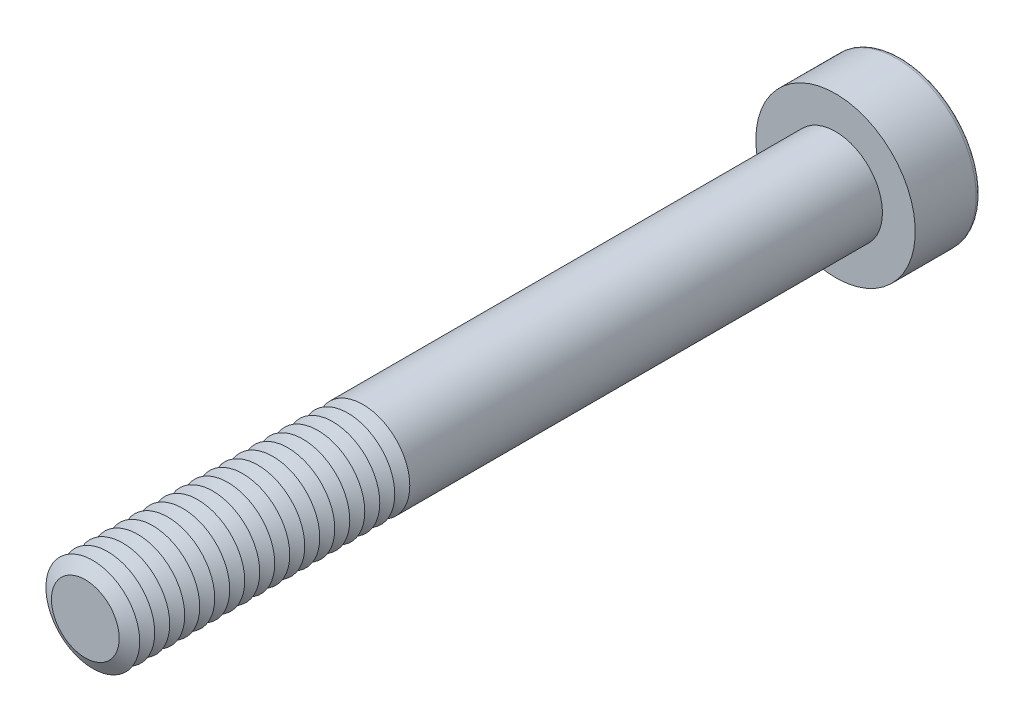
ISO-10303-21;
HEADER;
FILE_DESCRIPTION(('STEP AP214'),'2;1');
FILE_NAME('part.step','',(''),(''),'','','');
FILE_SCHEMA(('AUTOMOTIVE_DESIGN { 1 0 10303 214 1 1 1 1 }'));
ENDSEC;
DATA;
#1=APPLICATION_CONTEXT('core data for automotive mechanical design processes');
#2=APPLICATION_PROTOCOL_DEFINITION('international standard','automotive_design',2000,#1);
#3=PRODUCT_CONTEXT('',#1,'mechanical');
#4=PRODUCT('Part','Part','',(#3));
#5=PRODUCT_RELATED_PRODUCT_CATEGORY('part','',(#4));
#6=PRODUCT_DEFINITION_FORMATION('','',#4);
#7=PRODUCT_DEFINITION_CONTEXT('part definition',#1,'design');
#8=PRODUCT_DEFINITION('design','',#6,#7);
#9=PRODUCT_DEFINITION_SHAPE('','',#8);
#10=(LENGTH_UNIT() NAMED_UNIT(*) SI_UNIT(.MILLI.,.METRE.));
#11=(NAMED_UNIT(*) PLANE_ANGLE_UNIT() SI_UNIT($,.RADIAN.));
#12=(NAMED_UNIT(*) SI_UNIT($,.STERADIAN.) SOLID_ANGLE_UNIT());
#13=UNCERTAINTY_MEASURE_WITH_UNIT(LENGTH_MEASURE(1.E-05),#10,'distance_accuracy_value','');
#14=(GEOMETRIC_REPRESENTATION_CONTEXT(3) GLOBAL_UNCERTAINTY_ASSIGNED_CONTEXT((#13)) GLOBAL_UNIT_ASSIGNED_CONTEXT((#10,
#11,#12)) REPRESENTATION_CONTEXT('',''));
#15=CARTESIAN_POINT('',(0.,0.,0.));
#16=DIRECTION('',(0.,0.,1.));
#17=DIRECTION('',(1.,0.,0.));
#18=AXIS2_PLACEMENT_3D('',#15,#16,#17);
#19=CARTESIAN_POINT('',(0.,0.,37.2));
#20=DIRECTION('',(0.,0.,1.));
#21=DIRECTION('',(1.,0.,0.));
#22=AXIS2_PLACEMENT_3D('',#19,#20,#21);
#23=CONICAL_SURFACE('',#22,2.5,1.0471975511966);
#24=CARTESIAN_POINT('',(0.,0.,36.8));
#25=DIRECTION('',(0.,0.,1.));
#26=DIRECTION('',(1.,0.,0.));
#27=AXIS2_PLACEMENT_3D('',#24,#25,#26);
#28=CIRCLE('',#27,1.80717967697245);
#29=CARTESIAN_POINT('',(1.80717967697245,0.,36.8));
#30=VERTEX_POINT('',#29);
#31=EDGE_CURVE('E314',#30,#30,#28,.T.);
#32=ORIENTED_EDGE('',*,*,#31,.T.);
#33=EDGE_LOOP('',(#32));
#34=FACE_BOUND('',#33,.T.);
#35=CARTESIAN_POINT('',(0.,0.,37.2));
#36=DIRECTION('',(0.,0.,1.));
#37=DIRECTION('',(1.,0.,0.));
#38=AXIS2_PLACEMENT_3D('',#35,#36,#37);
#39=CIRCLE('',#38,2.5);
#40=CARTESIAN_POINT('',(2.5,0.,37.2));
#41=VERTEX_POINT('',#40);
#42=EDGE_CURVE('E317',#41,#41,#39,.T.);
#43=ORIENTED_EDGE('',*,*,#42,.F.);
#44=EDGE_LOOP('',(#43));
#45=FACE_BOUND('',#44,.T.);
#46=ADVANCED_FACE('F39',(#34,#45),#23,.T.);
#47=CARTESIAN_POINT('',(0.,0.,36.8));
#48=DIRECTION('',(0.,0.,-1.));
#49=DIRECTION('',(-1.,0.,0.));
#50=AXIS2_PLACEMENT_3D('',#47,#48,#49);
#51=CONICAL_SURFACE('',#50,1.80717967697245,1.04719755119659);
#52=CARTESIAN_POINT('',(0.,0.,36.4));
#53=DIRECTION('',(0.,0.,1.));
#54=DIRECTION('',(1.,0.,0.));
#55=AXIS2_PLACEMENT_3D('',#52,#53,#54);
#56=CIRCLE('',#55,2.5);
#57=CARTESIAN_POINT('',(2.5,0.,36.4));
#58=VERTEX_POINT('',#57);
#59=EDGE_CURVE('E325',#58,#58,#56,.T.);
#60=ORIENTED_EDGE('',*,*,#59,.T.);
#61=EDGE_LOOP('',(#60));
#62=FACE_BOUND('',#61,.T.);
#63=ORIENTED_EDGE('',*,*,#31,.F.);
#64=EDGE_LOOP('',(#63));
#65=FACE_BOUND('',#64,.T.);
#66=ADVANCED_FACE('F245',(#62,#65),#51,.T.);
#67=CARTESIAN_POINT('',(0.,0.,40.));
#68=DIRECTION('',(0.,0.,1.));
#69=DIRECTION('',(1.,0.,0.));
#70=AXIS2_PLACEMENT_3D('',#67,#68,#69);
#71=PLANE('',#70);
#72=CARTESIAN_POINT('',(0.,0.,40.));
#73=DIRECTION('',(0.,0.,1.));
#74=DIRECTION('',(1.,0.,0.));
#75=AXIS2_PLACEMENT_3D('',#72,#73,#74);
#76=CIRCLE('',#75,1.80717967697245);
#77=CARTESIAN_POINT('',(1.80717967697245,0.,40.));
#78=VERTEX_POINT('',#77);
#79=EDGE_CURVE('E174',#78,#78,#76,.T.);
#80=ORIENTED_EDGE('',*,*,#79,.T.);
#81=EDGE_LOOP('',(#80));
#82=FACE_BOUND('',#81,.T.);
#83=ADVANCED_FACE('F251',(#82),#71,.T.);
#84=CARTESIAN_POINT('',(0.,0.,40.));
#85=DIRECTION('',(0.,0.,-1.));
#86=DIRECTION('',(-1.,0.,0.));
#87=AXIS2_PLACEMENT_3D('',#84,#85,#86);
#88=CONICAL_SURFACE('',#87,1.80717967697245,1.04719755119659);
#89=CARTESIAN_POINT('',(0.,0.,39.6));
#90=DIRECTION('',(0.,0.,1.));
#91=DIRECTION('',(1.,0.,0.));
#92=AXIS2_PLACEMENT_3D('',#89,#90,#91);
#93=CIRCLE('',#92,2.5);
#94=CARTESIAN_POINT('',(2.5,0.,39.6));
#95=VERTEX_POINT('',#94);
#96=EDGE_CURVE('E291',#95,#95,#93,.T.);
#97=ORIENTED_EDGE('',*,*,#96,.T.);
#98=EDGE_LOOP('',(#97));
#99=FACE_BOUND('',#98,.T.);
#100=ORIENTED_EDGE('',*,*,#79,.F.);
#101=EDGE_LOOP('',(#100));
#102=FACE_BOUND('',#101,.T.);
#103=ADVANCED_FACE('F199',(#99,#102),#88,.T.);
#104=CARTESIAN_POINT('',(0.,0.,39.6));
#105=DIRECTION('',(0.,0.,1.));
#106=DIRECTION('',(1.,0.,0.));
#107=AXIS2_PLACEMENT_3D('',#104,#105,#106);
#108=CONICAL_SURFACE('',#107,2.5,1.0471975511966);
#109=CARTESIAN_POINT('',(0.,0.,39.2));
#110=DIRECTION('',(0.,0.,1.));
#111=DIRECTION('',(1.,0.,0.));
#112=AXIS2_PLACEMENT_3D('',#109,#110,#111);
#113=CIRCLE('',#112,1.80717967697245);
#114=CARTESIAN_POINT('',(1.80717967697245,0.,39.2));
#115=VERTEX_POINT('',#114);
#116=EDGE_CURVE('E288',#115,#115,#113,.T.);
#117=ORIENTED_EDGE('',*,*,#116,.T.);
#118=EDGE_LOOP('',(#117));
#119=FACE_BOUND('',#118,.T.);
#120=ORIENTED_EDGE('',*,*,#96,.F.);
#121=EDGE_LOOP('',(#120));
#122=FACE_BOUND('',#121,.T.);
#123=ADVANCED_FACE('F277',(#119,#122),#108,.T.);
#124=CARTESIAN_POINT('',(0.,0.,39.2));
#125=DIRECTION('',(0.,0.,-1.));
#126=DIRECTION('',(-1.,0.,0.));
#127=AXIS2_PLACEMENT_3D('',#124,#125,#126);
#128=CONICAL_SURFACE('',#127,1.80717967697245,1.04719755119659);
#129=CARTESIAN_POINT('',(0.,0.,38.8));
#130=DIRECTION('',(0.,0.,1.));
#131=DIRECTION('',(1.,0.,0.));
#132=AXIS2_PLACEMENT_3D('',#129,#130,#131);
#133=CIRCLE('',#132,2.5);
#134=CARTESIAN_POINT('',(2.5,0.,38.8));
#135=VERTEX_POINT('',#134);
#136=EDGE_CURVE('E300',#135,#135,#133,.T.);
#137=ORIENTED_EDGE('',*,*,#136,.T.);
#138=EDGE_LOOP('',(#137));
#139=FACE_BOUND('',#138,.T.);
#140=ORIENTED_EDGE('',*,*,#116,.F.);
#141=EDGE_LOOP('',(#140));
#142=FACE_BOUND('',#141,.T.);
#143=ADVANCED_FACE('F274',(#139,#142),#128,.T.);
#144=CARTESIAN_POINT('',(0.,0.,38.8));
#145=DIRECTION('',(0.,0.,1.));
#146=DIRECTION('',(1.,0.,0.));
#147=AXIS2_PLACEMENT_3D('',#144,#145,#146);
#148=CONICAL_SURFACE('',#147,2.5,1.0471975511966);
#149=CARTESIAN_POINT('',(0.,0.,38.4));
#150=DIRECTION('',(0.,0.,1.));
#151=DIRECTION('',(1.,0.,0.));
#152=AXIS2_PLACEMENT_3D('',#149,#150,#151);
#153=CIRCLE('',#152,1.80717967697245);
#154=CARTESIAN_POINT('',(1.80717967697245,0.,38.4));
#155=VERTEX_POINT('',#154);
#156=EDGE_CURVE('E293',#155,#155,#153,.T.);
#157=ORIENTED_EDGE('',*,*,#156,.T.);
#158=EDGE_LOOP('',(#157));
#159=FACE_BOUND('',#158,.T.);
#160=ORIENTED_EDGE('',*,*,#136,.F.);
#161=EDGE_LOOP('',(#160));
#162=FACE_BOUND('',#161,.T.);
#163=ADVANCED_FACE('F270',(#159,#162),#148,.T.);
#164=CARTESIAN_POINT('',(0.,0.,38.4));
#165=DIRECTION('',(0.,0.,-1.));
#166=DIRECTION('',(-1.,0.,0.));
#167=AXIS2_PLACEMENT_3D('',#164,#165,#166);
#168=CONICAL_SURFACE('',#167,1.80717967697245,1.04719755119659);
#169=CARTESIAN_POINT('',(0.,0.,38.));
#170=DIRECTION('',(0.,0.,1.));
#171=DIRECTION('',(1.,0.,0.));
#172=AXIS2_PLACEMENT_3D('',#169,#170,#171);
#173=CIRCLE('',#172,2.5);
#174=CARTESIAN_POINT('',(2.5,0.,38.));
#175=VERTEX_POINT('',#174);
#176=EDGE_CURVE('E310',#175,#175,#173,.T.);
#177=ORIENTED_EDGE('',*,*,#176,.T.);
#178=EDGE_LOOP('',(#177));
#179=FACE_BOUND('',#178,.T.);
#180=ORIENTED_EDGE('',*,*,#156,.F.);
#181=EDGE_LOOP('',(#180));
#182=FACE_BOUND('',#181,.T.);
#183=ADVANCED_FACE('F266',(#179,#182),#168,.T.);
#184=CARTESIAN_POINT('',(0.,0.,38.));
#185=DIRECTION('',(0.,0.,1.));
#186=DIRECTION('',(1.,0.,0.));
#187=AXIS2_PLACEMENT_3D('',#184,#185,#186);
#188=CONICAL_SURFACE('',#187,2.5,1.0471975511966);
#189=CARTESIAN_POINT('',(0.,0.,37.6));
#190=DIRECTION('',(0.,0.,1.));
#191=DIRECTION('',(1.,0.,0.));
#192=AXIS2_PLACEMENT_3D('',#189,#190,#191);
#193=CIRCLE('',#192,1.80717967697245);
#194=CARTESIAN_POINT('',(1.80717967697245,0.,37.6));
#195=VERTEX_POINT('',#194);
#196=EDGE_CURVE('E306',#195,#195,#193,.T.);
#197=ORIENTED_EDGE('',*,*,#196,.T.);
#198=EDGE_LOOP('',(#197));
#199=FACE_BOUND('',#198,.T.);
#200=ORIENTED_EDGE('',*,*,#176,.F.);
#201=EDGE_LOOP('',(#200));
#202=FACE_BOUND('',#201,.T.);
#203=ADVANCED_FACE('F262',(#199,#202),#188,.T.);
#204=CARTESIAN_POINT('',(0.,0.,37.6));
#205=DIRECTION('',(0.,0.,-1.));
#206=DIRECTION('',(-1.,0.,0.));
#207=AXIS2_PLACEMENT_3D('',#204,#205,#206);
#208=CONICAL_SURFACE('',#207,1.80717967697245,1.04719755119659);
#209=ORIENTED_EDGE('',*,*,#42,.T.);
#210=EDGE_LOOP('',(#209));
#211=FACE_BOUND('',#210,.T.);
#212=ORIENTED_EDGE('',*,*,#196,.F.);
#213=EDGE_LOOP('',(#212));
#214=FACE_BOUND('',#213,.T.);
#215=ADVANCED_FACE('F258',(#211,#214),#208,.T.);
#216=CARTESIAN_POINT('',(0.,0.,36.4));
#217=DIRECTION('',(0.,0.,1.));
#218=DIRECTION('',(1.,0.,0.));
#219=AXIS2_PLACEMENT_3D('',#216,#217,#218);
#220=CONICAL_SURFACE('',#219,2.5,1.0471975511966);
#221=CARTESIAN_POINT('',(0.,0.,36.));
#222=DIRECTION('',(0.,0.,1.));
#223=DIRECTION('',(1.,0.,0.));
#224=AXIS2_PLACEMENT_3D('',#221,#222,#223);
#225=CIRCLE('',#224,1.80717967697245);
#226=CARTESIAN_POINT('',(1.80717967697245,0.,36.));
#227=VERTEX_POINT('',#226);
#228=EDGE_CURVE('E321',#227,#227,#225,.T.);
#229=ORIENTED_EDGE('',*,*,#228,.T.);
#230=EDGE_LOOP('',(#229));
#231=FACE_BOUND('',#230,.T.);
#232=ORIENTED_EDGE('',*,*,#59,.F.);
#233=EDGE_LOOP('',(#232));
#234=FACE_BOUND('',#233,.T.);
#235=ADVANCED_FACE('F261',(#231,#234),#220,.T.);
#236=CARTESIAN_POINT('',(0.,0.,36.));
#237=DIRECTION('',(0.,0.,-1.));
#238=DIRECTION('',(-1.,0.,0.));
#239=AXIS2_PLACEMENT_3D('',#236,#237,#238);
#240=CONICAL_SURFACE('',#239,1.80717967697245,1.04719755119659);
#241=CARTESIAN_POINT('',(0.,0.,35.6));
#242=DIRECTION('',(0.,0.,1.));
#243=DIRECTION('',(1.,0.,0.));
#244=AXIS2_PLACEMENT_3D('',#241,#242,#243);
#245=CIRCLE('',#244,2.5);
#246=CARTESIAN_POINT('',(2.5,0.,35.6));
#247=VERTEX_POINT('',#246);
#248=EDGE_CURVE('E333',#247,#247,#245,.T.);
#249=ORIENTED_EDGE('',*,*,#248,.T.);
#250=EDGE_LOOP('',(#249));
#251=FACE_BOUND('',#250,.T.);
#252=ORIENTED_EDGE('',*,*,#228,.F.);
#253=EDGE_LOOP('',(#252));
#254=FACE_BOUND('',#253,.T.);
#255=ADVANCED_FACE('F545',(#251,#254),#240,.T.);
#256=CARTESIAN_POINT('',(0.,0.,35.6));
#257=DIRECTION('',(0.,0.,1.));
#258=DIRECTION('',(1.,0.,0.));
#259=AXIS2_PLACEMENT_3D('',#256,#257,#258);
#260=CONICAL_SURFACE('',#259,2.5,1.0471975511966);
#261=CARTESIAN_POINT('',(0.,0.,35.2));
#262=DIRECTION('',(0.,0.,1.));
#263=DIRECTION('',(1.,0.,0.));
#264=AXIS2_PLACEMENT_3D('',#261,#262,#263);
#265=CIRCLE('',#264,1.80717967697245);
#266=CARTESIAN_POINT('',(1.80717967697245,0.,35.2));
#267=VERTEX_POINT('',#266);
#268=EDGE_CURVE('E329',#267,#267,#265,.T.);
#269=ORIENTED_EDGE('',*,*,#268,.T.);
#270=EDGE_LOOP('',(#269));
#271=FACE_BOUND('',#270,.T.);
#272=ORIENTED_EDGE('',*,*,#248,.F.);
#273=EDGE_LOOP('',(#272));
#274=FACE_BOUND('',#273,.T.);
#275=ADVANCED_FACE('F541',(#271,#274),#260,.T.);
#276=CARTESIAN_POINT('',(0.,0.,35.2));
#277=DIRECTION('',(0.,0.,-1.));
#278=DIRECTION('',(-1.,0.,0.));
#279=AXIS2_PLACEMENT_3D('',#276,#277,#278);
#280=CONICAL_SURFACE('',#279,1.80717967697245,1.04719755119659);
#281=CARTESIAN_POINT('',(0.,0.,34.8));
#282=DIRECTION('',(0.,0.,1.));
#283=DIRECTION('',(1.,0.,0.));
#284=AXIS2_PLACEMENT_3D('',#281,#282,#283);
#285=CIRCLE('',#284,2.5);
#286=CARTESIAN_POINT('',(2.5,0.,34.8));
#287=VERTEX_POINT('',#286);
#288=EDGE_CURVE('E341',#287,#287,#285,.T.);
#289=ORIENTED_EDGE('',*,*,#288,.T.);
#290=EDGE_LOOP('',(#289));
#291=FACE_BOUND('',#290,.T.);
#292=ORIENTED_EDGE('',*,*,#268,.F.);
#293=EDGE_LOOP('',(#292));
#294=FACE_BOUND('',#293,.T.);
#295=ADVANCED_FACE('F537',(#291,#294),#280,.T.);
#296=CARTESIAN_POINT('',(0.,0.,34.8));
#297=DIRECTION('',(0.,0.,1.));
#298=DIRECTION('',(1.,0.,0.));
#299=AXIS2_PLACEMENT_3D('',#296,#297,#298);
#300=CONICAL_SURFACE('',#299,2.5,1.0471975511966);
#301=CARTESIAN_POINT('',(0.,0.,34.4));
#302=DIRECTION('',(0.,0.,1.));
#303=DIRECTION('',(1.,0.,0.));
#304=AXIS2_PLACEMENT_3D('',#301,#302,#303);
#305=CIRCLE('',#304,1.80717967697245);
#306=CARTESIAN_POINT('',(1.80717967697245,0.,34.4));
#307=VERTEX_POINT('',#306);
#308=EDGE_CURVE('E337',#307,#307,#305,.T.);
#309=ORIENTED_EDGE('',*,*,#308,.T.);
#310=EDGE_LOOP('',(#309));
#311=FACE_BOUND('',#310,.T.);
#312=ORIENTED_EDGE('',*,*,#288,.F.);
#313=EDGE_LOOP('',(#312));
#314=FACE_BOUND('',#313,.T.);
#315=ADVANCED_FACE('F533',(#311,#314),#300,.T.);
#316=CARTESIAN_POINT('',(0.,0.,34.4));
#317=DIRECTION('',(0.,0.,-1.));
#318=DIRECTION('',(-1.,0.,0.));
#319=AXIS2_PLACEMENT_3D('',#316,#317,#318);
#320=CONICAL_SURFACE('',#319,1.80717967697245,1.04719755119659);
#321=CARTESIAN_POINT('',(0.,0.,34.));
#322=DIRECTION('',(0.,0.,1.));
#323=DIRECTION('',(1.,0.,0.));
#324=AXIS2_PLACEMENT_3D('',#321,#322,#323);
#325=CIRCLE('',#324,2.5);
#326=CARTESIAN_POINT('',(2.5,0.,34.));
#327=VERTEX_POINT('',#326);
#328=EDGE_CURVE('E349',#327,#327,#325,.T.);
#329=ORIENTED_EDGE('',*,*,#328,.T.);
#330=EDGE_LOOP('',(#329));
#331=FACE_BOUND('',#330,.T.);
#332=ORIENTED_EDGE('',*,*,#308,.F.);
#333=EDGE_LOOP('',(#332));
#334=FACE_BOUND('',#333,.T.);
#335=ADVANCED_FACE('F529',(#331,#334),#320,.T.);
#336=CARTESIAN_POINT('',(0.,0.,34.));
#337=DIRECTION('',(0.,0.,1.));
#338=DIRECTION('',(1.,0.,0.));
#339=AXIS2_PLACEMENT_3D('',#336,#337,#338);
#340=CONICAL_SURFACE('',#339,2.5,1.0471975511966);
#341=CARTESIAN_POINT('',(0.,0.,33.6));
#342=DIRECTION('',(0.,0.,1.));
#343=DIRECTION('',(1.,0.,0.));
#344=AXIS2_PLACEMENT_3D('',#341,#342,#343);
#345=CIRCLE('',#344,1.80717967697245);
#346=CARTESIAN_POINT('',(1.80717967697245,0.,33.6));
#347=VERTEX_POINT('',#346);
#348=EDGE_CURVE('E345',#347,#347,#345,.T.);
#349=ORIENTED_EDGE('',*,*,#348,.T.);
#350=EDGE_LOOP('',(#349));
#351=FACE_BOUND('',#350,.T.);
#352=ORIENTED_EDGE('',*,*,#328,.F.);
#353=EDGE_LOOP('',(#352));
#354=FACE_BOUND('',#353,.T.);
#355=ADVANCED_FACE('F525',(#351,#354),#340,.T.);
#356=CARTESIAN_POINT('',(0.,0.,33.6));
#357=DIRECTION('',(0.,0.,-1.));
#358=DIRECTION('',(-1.,0.,0.));
#359=AXIS2_PLACEMENT_3D('',#356,#357,#358);
#360=CONICAL_SURFACE('',#359,1.80717967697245,1.04719755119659);
#361=CARTESIAN_POINT('',(0.,0.,33.2));
#362=DIRECTION('',(0.,0.,1.));
#363=DIRECTION('',(1.,0.,0.));
#364=AXIS2_PLACEMENT_3D('',#361,#362,#363);
#365=CIRCLE('',#364,2.5);
#366=CARTESIAN_POINT('',(2.5,0.,33.2));
#367=VERTEX_POINT('',#366);
#368=EDGE_CURVE('E357',#367,#367,#365,.T.);
#369=ORIENTED_EDGE('',*,*,#368,.T.);
#370=EDGE_LOOP('',(#369));
#371=FACE_BOUND('',#370,.T.);
#372=ORIENTED_EDGE('',*,*,#348,.F.);
#373=EDGE_LOOP('',(#372));
#374=FACE_BOUND('',#373,.T.);
#375=ADVANCED_FACE('F521',(#371,#374),#360,.T.);
#376=CARTESIAN_POINT('',(0.,0.,33.2));
#377=DIRECTION('',(0.,0.,1.));
#378=DIRECTION('',(1.,0.,0.));
#379=AXIS2_PLACEMENT_3D('',#376,#377,#378);
#380=CONICAL_SURFACE('',#379,2.5,1.0471975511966);
#381=CARTESIAN_POINT('',(0.,0.,32.8));
#382=DIRECTION('',(0.,0.,1.));
#383=DIRECTION('',(1.,0.,0.));
#384=AXIS2_PLACEMENT_3D('',#381,#382,#383);
#385=CIRCLE('',#384,1.80717967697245);
#386=CARTESIAN_POINT('',(1.80717967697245,0.,32.8));
#387=VERTEX_POINT('',#386);
#388=EDGE_CURVE('E353',#387,#387,#385,.T.);
#389=ORIENTED_EDGE('',*,*,#388,.T.);
#390=EDGE_LOOP('',(#389));
#391=FACE_BOUND('',#390,.T.);
#392=ORIENTED_EDGE('',*,*,#368,.F.);
#393=EDGE_LOOP('',(#392));
#394=FACE_BOUND('',#393,.T.);
#395=ADVANCED_FACE('F517',(#391,#394),#380,.T.);
#396=CARTESIAN_POINT('',(0.,0.,32.8));
#397=DIRECTION('',(0.,0.,-1.));
#398=DIRECTION('',(-1.,0.,0.));
#399=AXIS2_PLACEMENT_3D('',#396,#397,#398);
#400=CONICAL_SURFACE('',#399,1.80717967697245,1.04719755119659);
#401=CARTESIAN_POINT('',(0.,0.,32.4));
#402=DIRECTION('',(0.,0.,1.));
#403=DIRECTION('',(1.,0.,0.));
#404=AXIS2_PLACEMENT_3D('',#401,#402,#403);
#405=CIRCLE('',#404,2.5);
#406=CARTESIAN_POINT('',(2.5,0.,32.4));
#407=VERTEX_POINT('',#406);
#408=EDGE_CURVE('E364',#407,#407,#405,.T.);
#409=ORIENTED_EDGE('',*,*,#408,.T.);
#410=EDGE_LOOP('',(#409));
#411=FACE_BOUND('',#410,.T.);
#412=ORIENTED_EDGE('',*,*,#388,.F.);
#413=EDGE_LOOP('',(#412));
#414=FACE_BOUND('',#413,.T.);
#415=ADVANCED_FACE('F513',(#411,#414),#400,.T.);
#416=CARTESIAN_POINT('',(0.,0.,32.4));
#417=DIRECTION('',(0.,0.,1.));
#418=DIRECTION('',(1.,0.,0.));
#419=AXIS2_PLACEMENT_3D('',#416,#417,#418);
#420=CONICAL_SURFACE('',#419,2.5,1.0471975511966);
#421=CARTESIAN_POINT('',(0.,0.,32.));
#422=DIRECTION('',(0.,0.,1.));
#423=DIRECTION('',(1.,0.,0.));
#424=AXIS2_PLACEMENT_3D('',#421,#422,#423);
#425=CIRCLE('',#424,1.80717967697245);
#426=CARTESIAN_POINT('',(1.80717967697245,0.,32.));
#427=VERTEX_POINT('',#426);
#428=EDGE_CURVE('E360',#427,#427,#425,.T.);
#429=ORIENTED_EDGE('',*,*,#428,.T.);
#430=EDGE_LOOP('',(#429));
#431=FACE_BOUND('',#430,.T.);
#432=ORIENTED_EDGE('',*,*,#408,.F.);
#433=EDGE_LOOP('',(#432));
#434=FACE_BOUND('',#433,.T.);
#435=ADVANCED_FACE('F509',(#431,#434),#420,.T.);
#436=CARTESIAN_POINT('',(0.,0.,32.));
#437=DIRECTION('',(0.,0.,-1.));
#438=DIRECTION('',(-1.,0.,0.));
#439=AXIS2_PLACEMENT_3D('',#436,#437,#438);
#440=CONICAL_SURFACE('',#439,1.80717967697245,1.04719755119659);
#441=CARTESIAN_POINT('',(0.,0.,31.6));
#442=DIRECTION('',(0.,0.,1.));
#443=DIRECTION('',(1.,0.,0.));
#444=AXIS2_PLACEMENT_3D('',#441,#442,#443);
#445=CIRCLE('',#444,2.5);
#446=CARTESIAN_POINT('',(2.5,0.,31.6));
#447=VERTEX_POINT('',#446);
#448=EDGE_CURVE('E372',#447,#447,#445,.T.);
#449=ORIENTED_EDGE('',*,*,#448,.T.);
#450=EDGE_LOOP('',(#449));
#451=FACE_BOUND('',#450,.T.);
#452=ORIENTED_EDGE('',*,*,#428,.F.);
#453=EDGE_LOOP('',(#452));
#454=FACE_BOUND('',#453,.T.);
#455=ADVANCED_FACE('F505',(#451,#454),#440,.T.);
#456=CARTESIAN_POINT('',(0.,0.,31.6));
#457=DIRECTION('',(0.,0.,1.));
#458=DIRECTION('',(1.,0.,0.));
#459=AXIS2_PLACEMENT_3D('',#456,#457,#458);
#460=CONICAL_SURFACE('',#459,2.5,1.0471975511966);
#461=CARTESIAN_POINT('',(0.,0.,31.2));
#462=DIRECTION('',(0.,0.,1.));
#463=DIRECTION('',(1.,0.,0.));
#464=AXIS2_PLACEMENT_3D('',#461,#462,#463);
#465=CIRCLE('',#464,1.80717967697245);
#466=CARTESIAN_POINT('',(1.80717967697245,0.,31.2));
#467=VERTEX_POINT('',#466);
#468=EDGE_CURVE('E368',#467,#467,#465,.T.);
#469=ORIENTED_EDGE('',*,*,#468,.T.);
#470=EDGE_LOOP('',(#469));
#471=FACE_BOUND('',#470,.T.);
#472=ORIENTED_EDGE('',*,*,#448,.F.);
#473=EDGE_LOOP('',(#472));
#474=FACE_BOUND('',#473,.T.);
#475=ADVANCED_FACE('F501',(#471,#474),#460,.T.);
#476=CARTESIAN_POINT('',(0.,0.,31.2));
#477=DIRECTION('',(0.,0.,-1.));
#478=DIRECTION('',(-1.,0.,0.));
#479=AXIS2_PLACEMENT_3D('',#476,#477,#478);
#480=CONICAL_SURFACE('',#479,1.80717967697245,1.04719755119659);
#481=CARTESIAN_POINT('',(0.,0.,30.8));
#482=DIRECTION('',(0.,0.,1.));
#483=DIRECTION('',(1.,0.,0.));
#484=AXIS2_PLACEMENT_3D('',#481,#482,#483);
#485=CIRCLE('',#484,2.5);
#486=CARTESIAN_POINT('',(2.5,0.,30.8));
#487=VERTEX_POINT('',#486);
#488=EDGE_CURVE('E380',#487,#487,#485,.T.);
#489=ORIENTED_EDGE('',*,*,#488,.T.);
#490=EDGE_LOOP('',(#489));
#491=FACE_BOUND('',#490,.T.);
#492=ORIENTED_EDGE('',*,*,#468,.F.);
#493=EDGE_LOOP('',(#492));
#494=FACE_BOUND('',#493,.T.);
#495=ADVANCED_FACE('F497',(#491,#494),#480,.T.);
#496=CARTESIAN_POINT('',(0.,0.,30.8));
#497=DIRECTION('',(0.,0.,1.));
#498=DIRECTION('',(1.,0.,0.));
#499=AXIS2_PLACEMENT_3D('',#496,#497,#498);
#500=CONICAL_SURFACE('',#499,2.5,1.0471975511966);
#501=CARTESIAN_POINT('',(0.,0.,30.4));
#502=DIRECTION('',(0.,0.,1.));
#503=DIRECTION('',(1.,0.,0.));
#504=AXIS2_PLACEMENT_3D('',#501,#502,#503);
#505=CIRCLE('',#504,1.80717967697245);
#506=CARTESIAN_POINT('',(1.80717967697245,0.,30.4));
#507=VERTEX_POINT('',#506);
#508=EDGE_CURVE('E376',#507,#507,#505,.T.);
#509=ORIENTED_EDGE('',*,*,#508,.T.);
#510=EDGE_LOOP('',(#509));
#511=FACE_BOUND('',#510,.T.);
#512=ORIENTED_EDGE('',*,*,#488,.F.);
#513=EDGE_LOOP('',(#512));
#514=FACE_BOUND('',#513,.T.);
#515=ADVANCED_FACE('F493',(#511,#514),#500,.T.);
#516=CARTESIAN_POINT('',(0.,0.,30.4));
#517=DIRECTION('',(0.,0.,-1.));
#518=DIRECTION('',(-1.,0.,0.));
#519=AXIS2_PLACEMENT_3D('',#516,#517,#518);
#520=CONICAL_SURFACE('',#519,1.80717967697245,1.04719755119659);
#521=CARTESIAN_POINT('',(0.,0.,30.));
#522=DIRECTION('',(0.,0.,1.));
#523=DIRECTION('',(1.,0.,0.));
#524=AXIS2_PLACEMENT_3D('',#521,#522,#523);
#525=CIRCLE('',#524,2.5);
#526=CARTESIAN_POINT('',(2.5,0.,30.));
#527=VERTEX_POINT('',#526);
#528=EDGE_CURVE('E388',#527,#527,#525,.T.);
#529=ORIENTED_EDGE('',*,*,#528,.T.);
#530=EDGE_LOOP('',(#529));
#531=FACE_BOUND('',#530,.T.);
#532=ORIENTED_EDGE('',*,*,#508,.F.);
#533=EDGE_LOOP('',(#532));
#534=FACE_BOUND('',#533,.T.);
#535=ADVANCED_FACE('F489',(#531,#534),#520,.T.);
#536=CARTESIAN_POINT('',(0.,0.,30.));
#537=DIRECTION('',(0.,0.,1.));
#538=DIRECTION('',(1.,0.,0.));
#539=AXIS2_PLACEMENT_3D('',#536,#537,#538);
#540=CONICAL_SURFACE('',#539,2.5,1.0471975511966);
#541=CARTESIAN_POINT('',(0.,0.,29.6));
#542=DIRECTION('',(0.,0.,1.));
#543=DIRECTION('',(1.,0.,0.));
#544=AXIS2_PLACEMENT_3D('',#541,#542,#543);
#545=CIRCLE('',#544,1.80717967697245);
#546=CARTESIAN_POINT('',(1.80717967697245,0.,29.6));
#547=VERTEX_POINT('',#546);
#548=EDGE_CURVE('E384',#547,#547,#545,.T.);
#549=ORIENTED_EDGE('',*,*,#548,.T.);
#550=EDGE_LOOP('',(#549));
#551=FACE_BOUND('',#550,.T.);
#552=ORIENTED_EDGE('',*,*,#528,.F.);
#553=EDGE_LOOP('',(#552));
#554=FACE_BOUND('',#553,.T.);
#555=ADVANCED_FACE('F485',(#551,#554),#540,.T.);
#556=CARTESIAN_POINT('',(0.,0.,29.6));
#557=DIRECTION('',(0.,0.,-1.));
#558=DIRECTION('',(-1.,0.,0.));
#559=AXIS2_PLACEMENT_3D('',#556,#557,#558);
#560=CONICAL_SURFACE('',#559,1.80717967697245,1.04719755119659);
#561=CARTESIAN_POINT('',(0.,0.,29.2));
#562=DIRECTION('',(0.,0.,1.));
#563=DIRECTION('',(1.,0.,0.));
#564=AXIS2_PLACEMENT_3D('',#561,#562,#563);
#565=CIRCLE('',#564,2.5);
#566=CARTESIAN_POINT('',(2.5,0.,29.2));
#567=VERTEX_POINT('',#566);
#568=EDGE_CURVE('E396',#567,#567,#565,.T.);
#569=ORIENTED_EDGE('',*,*,#568,.T.);
#570=EDGE_LOOP('',(#569));
#571=FACE_BOUND('',#570,.T.);
#572=ORIENTED_EDGE('',*,*,#548,.F.);
#573=EDGE_LOOP('',(#572));
#574=FACE_BOUND('',#573,.T.);
#575=ADVANCED_FACE('F481',(#571,#574),#560,.T.);
#576=CARTESIAN_POINT('',(0.,0.,29.2));
#577=DIRECTION('',(0.,0.,1.));
#578=DIRECTION('',(1.,0.,0.));
#579=AXIS2_PLACEMENT_3D('',#576,#577,#578);
#580=CONICAL_SURFACE('',#579,2.5,1.0471975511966);
#581=CARTESIAN_POINT('',(0.,0.,28.8));
#582=DIRECTION('',(0.,0.,1.));
#583=DIRECTION('',(1.,0.,0.));
#584=AXIS2_PLACEMENT_3D('',#581,#582,#583);
#585=CIRCLE('',#584,1.80717967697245);
#586=CARTESIAN_POINT('',(1.80717967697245,0.,28.8));
#587=VERTEX_POINT('',#586);
#588=EDGE_CURVE('E392',#587,#587,#585,.T.);
#589=ORIENTED_EDGE('',*,*,#588,.T.);
#590=EDGE_LOOP('',(#589));
#591=FACE_BOUND('',#590,.T.);
#592=ORIENTED_EDGE('',*,*,#568,.F.);
#593=EDGE_LOOP('',(#592));
#594=FACE_BOUND('',#593,.T.);
#595=ADVANCED_FACE('F477',(#591,#594),#580,.T.);
#596=CARTESIAN_POINT('',(0.,0.,28.8));
#597=DIRECTION('',(0.,0.,-1.));
#598=DIRECTION('',(-1.,0.,0.));
#599=AXIS2_PLACEMENT_3D('',#596,#597,#598);
#600=CONICAL_SURFACE('',#599,1.80717967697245,1.04719755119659);
#601=CARTESIAN_POINT('',(0.,0.,28.4));
#602=DIRECTION('',(0.,0.,1.));
#603=DIRECTION('',(1.,0.,0.));
#604=AXIS2_PLACEMENT_3D('',#601,#602,#603);
#605=CIRCLE('',#604,2.5);
#606=CARTESIAN_POINT('',(2.5,0.,28.4));
#607=VERTEX_POINT('',#606);
#608=EDGE_CURVE('E404',#607,#607,#605,.T.);
#609=ORIENTED_EDGE('',*,*,#608,.T.);
#610=EDGE_LOOP('',(#609));
#611=FACE_BOUND('',#610,.T.);
#612=ORIENTED_EDGE('',*,*,#588,.F.);
#613=EDGE_LOOP('',(#612));
#614=FACE_BOUND('',#613,.T.);
#615=ADVANCED_FACE('F473',(#611,#614),#600,.T.);
#616=CARTESIAN_POINT('',(0.,0.,28.4));
#617=DIRECTION('',(0.,0.,1.));
#618=DIRECTION('',(1.,0.,0.));
#619=AXIS2_PLACEMENT_3D('',#616,#617,#618);
#620=CONICAL_SURFACE('',#619,2.5,1.0471975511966);
#621=CARTESIAN_POINT('',(0.,0.,28.));
#622=DIRECTION('',(0.,0.,1.));
#623=DIRECTION('',(1.,0.,0.));
#624=AXIS2_PLACEMENT_3D('',#621,#622,#623);
#625=CIRCLE('',#624,1.80717967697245);
#626=CARTESIAN_POINT('',(1.80717967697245,0.,28.));
#627=VERTEX_POINT('',#626);
#628=EDGE_CURVE('E400',#627,#627,#625,.T.);
#629=ORIENTED_EDGE('',*,*,#628,.T.);
#630=EDGE_LOOP('',(#629));
#631=FACE_BOUND('',#630,.T.);
#632=ORIENTED_EDGE('',*,*,#608,.F.);
#633=EDGE_LOOP('',(#632));
#634=FACE_BOUND('',#633,.T.);
#635=ADVANCED_FACE('F469',(#631,#634),#620,.T.);
#636=CARTESIAN_POINT('',(0.,0.,28.));
#637=DIRECTION('',(0.,0.,-1.));
#638=DIRECTION('',(-1.,0.,0.));
#639=AXIS2_PLACEMENT_3D('',#636,#637,#638);
#640=CONICAL_SURFACE('',#639,1.80717967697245,1.04719755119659);
#641=CARTESIAN_POINT('',(0.,0.,27.6));
#642=DIRECTION('',(0.,0.,1.));
#643=DIRECTION('',(1.,0.,0.));
#644=AXIS2_PLACEMENT_3D('',#641,#642,#643);
#645=CIRCLE('',#644,2.5);
#646=CARTESIAN_POINT('',(2.5,0.,27.6));
#647=VERTEX_POINT('',#646);
#648=EDGE_CURVE('E412',#647,#647,#645,.T.);
#649=ORIENTED_EDGE('',*,*,#648,.T.);
#650=EDGE_LOOP('',(#649));
#651=FACE_BOUND('',#650,.T.);
#652=ORIENTED_EDGE('',*,*,#628,.F.);
#653=EDGE_LOOP('',(#652));
#654=FACE_BOUND('',#653,.T.);
#655=ADVANCED_FACE('F465',(#651,#654),#640,.T.);
#656=CARTESIAN_POINT('',(0.,0.,27.6));
#657=DIRECTION('',(0.,0.,1.));
#658=DIRECTION('',(1.,0.,0.));
#659=AXIS2_PLACEMENT_3D('',#656,#657,#658);
#660=CONICAL_SURFACE('',#659,2.5,1.0471975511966);
#661=CARTESIAN_POINT('',(0.,0.,27.2));
#662=DIRECTION('',(0.,0.,1.));
#663=DIRECTION('',(1.,0.,0.));
#664=AXIS2_PLACEMENT_3D('',#661,#662,#663);
#665=CIRCLE('',#664,1.80717967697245);
#666=CARTESIAN_POINT('',(1.80717967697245,0.,27.2));
#667=VERTEX_POINT('',#666);
#668=EDGE_CURVE('E408',#667,#667,#665,.T.);
#669=ORIENTED_EDGE('',*,*,#668,.T.);
#670=EDGE_LOOP('',(#669));
#671=FACE_BOUND('',#670,.T.);
#672=ORIENTED_EDGE('',*,*,#648,.F.);
#673=EDGE_LOOP('',(#672));
#674=FACE_BOUND('',#673,.T.);
#675=ADVANCED_FACE('F461',(#671,#674),#660,.T.);
#676=CARTESIAN_POINT('',(0.,0.,27.2));
#677=DIRECTION('',(0.,0.,-1.));
#678=DIRECTION('',(-1.,0.,0.));
#679=AXIS2_PLACEMENT_3D('',#676,#677,#678);
#680=CONICAL_SURFACE('',#679,1.80717967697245,1.04719755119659);
#681=CARTESIAN_POINT('',(0.,0.,26.8));
#682=DIRECTION('',(0.,0.,1.));
#683=DIRECTION('',(1.,0.,0.));
#684=AXIS2_PLACEMENT_3D('',#681,#682,#683);
#685=CIRCLE('',#684,2.5);
#686=CARTESIAN_POINT('',(2.5,0.,26.8));
#687=VERTEX_POINT('',#686);
#688=EDGE_CURVE('E420',#687,#687,#685,.T.);
#689=ORIENTED_EDGE('',*,*,#688,.T.);
#690=EDGE_LOOP('',(#689));
#691=FACE_BOUND('',#690,.T.);
#692=ORIENTED_EDGE('',*,*,#668,.F.);
#693=EDGE_LOOP('',(#692));
#694=FACE_BOUND('',#693,.T.);
#695=ADVANCED_FACE('F457',(#691,#694),#680,.T.);
#696=CARTESIAN_POINT('',(0.,0.,26.8));
#697=DIRECTION('',(0.,0.,1.));
#698=DIRECTION('',(1.,0.,0.));
#699=AXIS2_PLACEMENT_3D('',#696,#697,#698);
#700=CONICAL_SURFACE('',#699,2.5,1.0471975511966);
#701=CARTESIAN_POINT('',(0.,0.,26.4));
#702=DIRECTION('',(0.,0.,1.));
#703=DIRECTION('',(1.,0.,0.));
#704=AXIS2_PLACEMENT_3D('',#701,#702,#703);
#705=CIRCLE('',#704,1.80717967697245);
#706=CARTESIAN_POINT('',(1.80717967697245,0.,26.4));
#707=VERTEX_POINT('',#706);
#708=EDGE_CURVE('E416',#707,#707,#705,.T.);
#709=ORIENTED_EDGE('',*,*,#708,.T.);
#710=EDGE_LOOP('',(#709));
#711=FACE_BOUND('',#710,.T.);
#712=ORIENTED_EDGE('',*,*,#688,.F.);
#713=EDGE_LOOP('',(#712));
#714=FACE_BOUND('',#713,.T.);
#715=ADVANCED_FACE('F452',(#711,#714),#700,.T.);
#716=CARTESIAN_POINT('',(0.,0.,26.4));
#717=DIRECTION('',(0.,0.,-1.));
#718=DIRECTION('',(-1.,0.,0.));
#719=AXIS2_PLACEMENT_3D('',#716,#717,#718);
#720=CONICAL_SURFACE('',#719,1.80717967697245,1.04719755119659);
#721=CARTESIAN_POINT('',(0.,0.,26.));
#722=DIRECTION('',(0.,0.,1.));
#723=DIRECTION('',(1.,0.,0.));
#724=AXIS2_PLACEMENT_3D('',#721,#722,#723);
#725=CIRCLE('',#724,2.5);
#726=CARTESIAN_POINT('',(2.5,0.,26.));
#727=VERTEX_POINT('',#726);
#728=EDGE_CURVE('E432',#727,#727,#725,.T.);
#729=ORIENTED_EDGE('',*,*,#728,.T.);
#730=EDGE_LOOP('',(#729));
#731=FACE_BOUND('',#730,.T.);
#732=ORIENTED_EDGE('',*,*,#708,.F.);
#733=EDGE_LOOP('',(#732));
#734=FACE_BOUND('',#733,.T.);
#735=ADVANCED_FACE('F438',(#731,#734),#720,.T.);
#736=CARTESIAN_POINT('',(0.,0.,26.));
#737=DIRECTION('',(0.,0.,1.));
#738=DIRECTION('',(1.,0.,0.));
#739=AXIS2_PLACEMENT_3D('',#736,#737,#738);
#740=CONICAL_SURFACE('',#739,2.5,1.0471975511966);
#741=CARTESIAN_POINT('',(0.,0.,25.6));
#742=DIRECTION('',(0.,0.,1.));
#743=DIRECTION('',(1.,0.,0.));
#744=AXIS2_PLACEMENT_3D('',#741,#742,#743);
#745=CIRCLE('',#744,1.80717967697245);
#746=CARTESIAN_POINT('',(1.80717967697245,0.,25.6));
#747=VERTEX_POINT('',#746);
#748=EDGE_CURVE('E424',#747,#747,#745,.T.);
#749=ORIENTED_EDGE('',*,*,#748,.T.);
#750=EDGE_LOOP('',(#749));
#751=FACE_BOUND('',#750,.T.);
#752=ORIENTED_EDGE('',*,*,#728,.F.);
#753=EDGE_LOOP('',(#752));
#754=FACE_BOUND('',#753,.T.);
#755=ADVANCED_FACE('F441',(#751,#754),#740,.T.);
#756=CARTESIAN_POINT('',(0.,0.,25.6));
#757=DIRECTION('',(0.,0.,-1.));
#758=DIRECTION('',(-1.,0.,0.));
#759=AXIS2_PLACEMENT_3D('',#756,#757,#758);
#760=CONICAL_SURFACE('',#759,1.80717967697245,1.04719755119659);
#761=CARTESIAN_POINT('',(0.,0.,25.2));
#762=DIRECTION('',(0.,0.,1.));
#763=DIRECTION('',(1.,0.,0.));
#764=AXIS2_PLACEMENT_3D('',#761,#762,#763);
#765=CIRCLE('',#764,2.5);
#766=CARTESIAN_POINT('',(2.5,0.,25.2));
#767=VERTEX_POINT('',#766);
#768=EDGE_CURVE('E428',#767,#767,#765,.T.);
#769=ORIENTED_EDGE('',*,*,#768,.T.);
#770=EDGE_LOOP('',(#769));
#771=FACE_BOUND('',#770,.T.);
#772=ORIENTED_EDGE('',*,*,#748,.F.);
#773=EDGE_LOOP('',(#772));
#774=FACE_BOUND('',#773,.T.);
#775=ADVANCED_FACE('F443',(#771,#774),#760,.T.);
#776=CARTESIAN_POINT('',(0.,0.,-1.25));
#777=DIRECTION('',(0.,0.,-1.));
#778=DIRECTION('',(-1.,0.,0.));
#779=AXIS2_PLACEMENT_3D('',#776,#777,#778);
#780=CONICAL_SURFACE('',#779,1.5,1.0471975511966);
#781=CARTESIAN_POINT('',(0.,0.,-0.383974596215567));
#782=VERTEX_POINT('',#781);
#783=VERTEX_LOOP('',#782);
#784=FACE_BOUND('',#783,.T.);
#785=CARTESIAN_POINT('',(0.,0.,-1.25));
#786=DIRECTION('',(0.,0.,-1.));
#787=DIRECTION('',(-1.,0.,0.));
#788=AXIS2_PLACEMENT_3D('',#785,#786,#787);
#789=CIRCLE('',#788,1.5);
#790=CARTESIAN_POINT('',(-1.29903810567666,0.749999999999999,-1.25));
#791=VERTEX_POINT('',#790);
#792=CARTESIAN_POINT('',(0.,1.5,-1.25));
#793=VERTEX_POINT('',#792);
#794=EDGE_CURVE('E149',#791,#793,#789,.T.);
#795=ORIENTED_EDGE('',*,*,#794,.T.);
#796=CARTESIAN_POINT('',(0.,0.,-1.25));
#797=DIRECTION('',(0.,0.,-1.));
#798=DIRECTION('',(-1.,0.,0.));
#799=AXIS2_PLACEMENT_3D('',#796,#797,#798);
#800=CIRCLE('',#799,1.5);
#801=CARTESIAN_POINT('',(1.29903810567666,0.75,-1.25));
#802=VERTEX_POINT('',#801);
#803=EDGE_CURVE('E54',#793,#802,#800,.T.);
#804=ORIENTED_EDGE('',*,*,#803,.T.);
#805=CARTESIAN_POINT('',(1.29903810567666,-0.75,-1.25));
#806=VERTEX_POINT('',#805);
#807=EDGE_CURVE('E1087',#802,#806,#800,.T.);
#808=ORIENTED_EDGE('',*,*,#807,.T.);
#809=CARTESIAN_POINT('',(0.,-1.5,-1.25));
#810=VERTEX_POINT('',#809);
#811=EDGE_CURVE('E1085',#806,#810,#800,.T.);
#812=ORIENTED_EDGE('',*,*,#811,.T.);
#813=CARTESIAN_POINT('',(-1.29903810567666,-0.749999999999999,-1.25));
#814=VERTEX_POINT('',#813);
#815=EDGE_CURVE('E1080',#810,#814,#800,.T.);
#816=ORIENTED_EDGE('',*,*,#815,.T.);
#817=EDGE_CURVE('E1078',#814,#791,#800,.T.);
#818=ORIENTED_EDGE('',*,*,#817,.T.);
#819=EDGE_LOOP('',(#795,#804,#808,#812,#816,#818));
#820=FACE_BOUND('',#819,.T.);
#821=ADVANCED_FACE('F201',(#784,#820),#780,.F.);
#822=CARTESIAN_POINT('',(0.,0.,-1.25));
#823=DIRECTION('',(0.,0.,-1.));
#824=DIRECTION('',(-1.,0.,0.));
#825=AXIS2_PLACEMENT_3D('',#822,#823,#824);
#826=PLANE('',#825);
#827=ORIENTED_EDGE('',*,*,#803,.F.);
#828=DIRECTION('',(1.,0.,0.));
#829=VECTOR('',#828,1.);
#830=CARTESIAN_POINT('',(-0.866025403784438,1.5,-1.25));
#831=LINE('',#830,#829);
#832=CARTESIAN_POINT('',(0.86602540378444,1.5,-1.25));
#833=VERTEX_POINT('',#832);
#834=EDGE_CURVE('E1129',#793,#833,#831,.T.);
#835=ORIENTED_EDGE('',*,*,#834,.T.);
#836=DIRECTION('',(0.5,-0.866025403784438,0.));
#837=VECTOR('',#836,1.);
#838=CARTESIAN_POINT('',(0.86602540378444,1.5,-1.25));
#839=LINE('',#838,#837);
#840=EDGE_CURVE('E155',#833,#802,#839,.T.);
#841=ORIENTED_EDGE('',*,*,#840,.T.);
#842=EDGE_LOOP('',(#827,#835,#841));
#843=FACE_BOUND('',#842,.T.);
#844=ADVANCED_FACE('F652',(#843),#826,.T.);
#845=ORIENTED_EDGE('',*,*,#807,.F.);
#846=CARTESIAN_POINT('',(1.73205080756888,0.,-1.25));
#847=VERTEX_POINT('',#846);
#848=EDGE_CURVE('E1125',#802,#847,#839,.T.);
#849=ORIENTED_EDGE('',*,*,#848,.T.);
#850=DIRECTION('',(-0.5,-0.866025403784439,0.));
#851=VECTOR('',#850,1.);
#852=CARTESIAN_POINT('',(1.73205080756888,0.,-1.25));
#853=LINE('',#852,#851);
#854=EDGE_CURVE('E1100',#847,#806,#853,.T.);
#855=ORIENTED_EDGE('',*,*,#854,.T.);
#856=EDGE_LOOP('',(#845,#849,#855));
#857=FACE_BOUND('',#856,.T.);
#858=ADVANCED_FACE('F662',(#857),#826,.T.);
#859=ORIENTED_EDGE('',*,*,#811,.F.);
#860=CARTESIAN_POINT('',(0.86602540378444,-1.5,-1.25));
#861=VERTEX_POINT('',#860);
#862=EDGE_CURVE('E1102',#806,#861,#853,.T.);
#863=ORIENTED_EDGE('',*,*,#862,.T.);
#864=DIRECTION('',(-1.,0.,0.));
#865=VECTOR('',#864,1.);
#866=CARTESIAN_POINT('',(0.86602540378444,-1.5,-1.25));
#867=LINE('',#866,#865);
#868=EDGE_CURVE('E1055',#861,#810,#867,.T.);
#869=ORIENTED_EDGE('',*,*,#868,.T.);
#870=EDGE_LOOP('',(#859,#863,#869));
#871=FACE_BOUND('',#870,.T.);
#872=ADVANCED_FACE('F672',(#871),#826,.T.);
#873=ORIENTED_EDGE('',*,*,#815,.F.);
#874=CARTESIAN_POINT('',(-0.866025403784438,-1.5,-1.25));
#875=VERTEX_POINT('',#874);
#876=EDGE_CURVE('E1096',#810,#875,#867,.T.);
#877=ORIENTED_EDGE('',*,*,#876,.T.);
#878=DIRECTION('',(-0.5,0.866025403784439,0.));
#879=VECTOR('',#878,1.);
#880=CARTESIAN_POINT('',(-0.866025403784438,-1.5,-1.25));
#881=LINE('',#880,#879);
#882=EDGE_CURVE('E1098',#875,#814,#881,.T.);
#883=ORIENTED_EDGE('',*,*,#882,.T.);
#884=EDGE_LOOP('',(#873,#877,#883));
#885=FACE_BOUND('',#884,.T.);
#886=ADVANCED_FACE('F680',(#885),#826,.T.);
#887=ORIENTED_EDGE('',*,*,#817,.F.);
#888=CARTESIAN_POINT('',(-1.73205080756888,0.,-1.25));
#889=VERTEX_POINT('',#888);
#890=EDGE_CURVE('E1103',#814,#889,#881,.T.);
#891=ORIENTED_EDGE('',*,*,#890,.T.);
#892=DIRECTION('',(0.5,0.866025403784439,0.));
#893=VECTOR('',#892,1.);
#894=CARTESIAN_POINT('',(-1.73205080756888,0.,-1.25));
#895=LINE('',#894,#893);
#896=EDGE_CURVE('E158',#889,#791,#895,.T.);
#897=ORIENTED_EDGE('',*,*,#896,.T.);
#898=EDGE_LOOP('',(#887,#891,#897));
#899=FACE_BOUND('',#898,.T.);
#900=ADVANCED_FACE('F231',(#899),#826,.T.);
#901=ORIENTED_EDGE('',*,*,#794,.F.);
#902=CARTESIAN_POINT('',(-0.866025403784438,1.5,-1.25));
#903=VERTEX_POINT('',#902);
#904=EDGE_CURVE('E1109',#791,#903,#895,.T.);
#905=ORIENTED_EDGE('',*,*,#904,.T.);
#906=EDGE_CURVE('E1127',#903,#793,#831,.T.);
#907=ORIENTED_EDGE('',*,*,#906,.T.);
#908=EDGE_LOOP('',(#901,#905,#907));
#909=FACE_BOUND('',#908,.T.);
#910=ADVANCED_FACE('F664',(#909),#826,.T.);
#911=CARTESIAN_POINT('',(-0.866025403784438,1.5,-1.25));
#912=DIRECTION('',(0.,1.,0.));
#913=DIRECTION('',(-1.,0.,0.));
#914=AXIS2_PLACEMENT_3D('',#911,#912,#913);
#915=PLANE('',#914);
#916=DIRECTION('',(0.,0.,-1.));
#917=VECTOR('',#916,1.);
#918=CARTESIAN_POINT('',(-0.866025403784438,1.5,-1.25));
#919=LINE('',#918,#917);
#920=CARTESIAN_POINT('',(-0.866025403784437,1.5,-3.5));
#921=VERTEX_POINT('',#920);
#922=EDGE_CURVE('E147',#903,#921,#919,.T.);
#923=ORIENTED_EDGE('',*,*,#922,.T.);
#924=CARTESIAN_POINT('',(-2.26080568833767,1.5,-3.76288767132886));
#925=CARTESIAN_POINT('',(-2.19307335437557,1.5,-3.74776718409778));
#926=CARTESIAN_POINT('',(-2.12529797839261,1.5,-3.73283936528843));
#927=CARTESIAN_POINT('',(-1.989639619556,1.5,-3.7034664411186));
#928=CARTESIAN_POINT('',(-1.92175663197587,1.5,-3.6890213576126));
#929=CARTESIAN_POINT('',(-1.71778516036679,1.5,-3.6465295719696));
#930=CARTESIAN_POINT('',(-1.58151166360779,1.5,-3.61935744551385));
#931=CARTESIAN_POINT('',(-1.30947840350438,1.5,-3.56878855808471));
#932=CARTESIAN_POINT('',(-1.17372447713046,1.5,-3.54536102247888));
#933=CARTESIAN_POINT('',(-0.90140428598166,1.5,-3.50385032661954));
#934=CARTESIAN_POINT('',(-0.764838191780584,1.5,-3.48576608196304));
#935=CARTESIAN_POINT('',(-0.489293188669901,1.5,-3.45729203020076));
#936=CARTESIAN_POINT('',(-0.350304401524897,1.5,-3.44699084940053));
#937=CARTESIAN_POINT('',(-0.14157144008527,1.5,-3.43918165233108));
#938=CARTESIAN_POINT('',(-0.0719628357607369,1.5,-3.43785196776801));
#939=CARTESIAN_POINT('',(0.0672555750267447,1.5,-3.43779336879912));
#940=CARTESIAN_POINT('',(0.136865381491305,1.5,-3.43906445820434));
#941=CARTESIAN_POINT('',(0.346114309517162,1.5,-3.44672257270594));
#942=CARTESIAN_POINT('',(0.48561964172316,1.5,-3.45697478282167));
#943=CARTESIAN_POINT('',(0.76382969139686,1.5,-3.48560011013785));
#944=CARTESIAN_POINT('',(0.902533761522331,1.5,-3.50397905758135));
#945=CARTESIAN_POINT('',(1.18270277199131,1.5,-3.54677522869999));
#946=CARTESIAN_POINT('',(1.32414472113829,1.5,-3.57133816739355));
#947=CARTESIAN_POINT('',(1.60634089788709,1.5,-3.62417713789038));
#948=CARTESIAN_POINT('',(1.74709501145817,1.5,-3.65245376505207));
#949=CARTESIAN_POINT('',(2.02813527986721,1.5,-3.71141289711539));
#950=CARTESIAN_POINT('',(2.16842128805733,1.5,-3.74209609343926));
#951=CARTESIAN_POINT('',(2.44863558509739,1.5,-3.80505759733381));
#952=CARTESIAN_POINT('',(2.5885638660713,1.5,-3.8373359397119));
#953=CARTESIAN_POINT('',(2.86645602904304,1.5,-3.90258693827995));
#954=CARTESIAN_POINT('',(3.0044230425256,1.5,-3.93554631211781));
#955=CARTESIAN_POINT('',(3.28017563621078,1.5,-4.00222717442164));
#956=CARTESIAN_POINT('',(3.41796121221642,1.5,-4.03594868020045));
#957=CARTESIAN_POINT('',(3.69320305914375,1.5,-4.10389962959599));
#958=CARTESIAN_POINT('',(3.83065952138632,1.5,-4.13812829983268));
#959=CARTESIAN_POINT('',(4.10546119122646,1.5,-4.20700872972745));
#960=CARTESIAN_POINT('',(4.24280640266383,1.5,-4.2416604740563));
#961=CARTESIAN_POINT('',(4.38011382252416,1.5,-4.27645965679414));
#962=B_SPLINE_CURVE_WITH_KNOTS('',3,(#924,#925,#926,#927,#928,#929,#930,#931,#932,#933,#934,
#935,#936,#937,#938,#939,#940,#941,#942,#943,#944,#945,#946,#947,#948,#949,#950,#951,#952,#953,
#954,#955,#956,#957,#958,#959,#960,#961),.UNSPECIFIED.,.F.,.F.,(4,2,2,2,2,2,2,2,2,2,2,2,2,2,2,2,
2,2,4),(0.,0.208198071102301,0.416405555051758,0.833243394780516,1.2464565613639,
1.65958581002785,2.07735129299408,2.28617008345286,2.49498917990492,2.91428402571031,
3.33388016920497,3.76448033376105,4.19514961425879,4.62594308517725,5.05674596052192,
5.48229088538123,5.90784548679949,6.33280701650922,6.75775319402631),.UNSPECIFIED.);
#963=CARTESIAN_POINT('',(0.866025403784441,1.5,-3.5));
#964=VERTEX_POINT('',#963);
#965=EDGE_CURVE('E124',#921,#964,#962,.T.);
#966=ORIENTED_EDGE('',*,*,#965,.T.);
#967=DIRECTION('',(0.,0.,-1.));
#968=VECTOR('',#967,1.);
#969=CARTESIAN_POINT('',(0.86602540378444,1.5,-1.25));
#970=LINE('',#969,#968);
#971=EDGE_CURVE('E143',#833,#964,#970,.T.);
#972=ORIENTED_EDGE('',*,*,#971,.F.);
#973=ORIENTED_EDGE('',*,*,#834,.F.);
#974=ORIENTED_EDGE('',*,*,#906,.F.);
#975=EDGE_LOOP('',(#923,#966,#972,#973,#974));
#976=FACE_BOUND('',#975,.T.);
#977=ADVANCED_FACE('F141',(#976),#915,.F.);
#978=CARTESIAN_POINT('',(0.86602540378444,1.5,-1.25));
#979=DIRECTION('',(0.866025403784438,0.5,0.));
#980=DIRECTION('',(-0.5,0.866025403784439,0.));
#981=AXIS2_PLACEMENT_3D('',#978,#979,#980);
#982=PLANE('',#981);
#983=ORIENTED_EDGE('',*,*,#971,.T.);
#984=CARTESIAN_POINT('',(0.865909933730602,1.5002,-3.50003094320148));
#985=CARTESIAN_POINT('',(0.901883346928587,1.43789222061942,-3.49038632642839));
#986=CARTESIAN_POINT('',(0.937921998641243,1.37547144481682,-3.48163049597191));
#987=CARTESIAN_POINT('',(1.01012661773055,1.25040937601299,-3.46624719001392));
#988=CARTESIAN_POINT('',(1.04629263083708,1.18776800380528,-3.4596205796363));
#989=CARTESIAN_POINT('',(1.11853262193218,1.06264466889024,-3.44888268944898));
#990=CARTESIAN_POINT('',(1.15460611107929,1.00016355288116,-3.44475860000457));
#991=CARTESIAN_POINT('',(1.22679910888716,0.875121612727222,-3.43922860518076));
#992=CARTESIAN_POINT('',(1.26291860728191,0.812560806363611,-3.43782217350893));
#993=CARTESIAN_POINT('',(1.33515760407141,0.68743919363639,-3.43782217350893));
#994=CARTESIAN_POINT('',(1.37127710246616,0.62487838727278,-3.43922860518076));
#995=CARTESIAN_POINT('',(1.44347010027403,0.49983644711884,-3.44475860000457));
#996=CARTESIAN_POINT('',(1.47954358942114,0.437355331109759,-3.44888268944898));
#997=CARTESIAN_POINT('',(1.55178358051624,0.312231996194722,-3.4596205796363));
#998=CARTESIAN_POINT('',(1.58794959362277,0.249590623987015,-3.46624719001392));
#999=CARTESIAN_POINT('',(1.66015421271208,0.124528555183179,-3.48163049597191));
#1000=CARTESIAN_POINT('',(1.69619286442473,0.0621077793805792,-3.49038632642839));
#1001=CARTESIAN_POINT('',(1.73216627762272,-0.000199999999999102,-3.50003094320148));
#1002=B_SPLINE_CURVE_WITH_KNOTS('',3,(#984,#985,#986,#987,#988,#989,#990,#991,#992,#993,#994,
#995,#996,#997,#998,#999,#1000,#1001),.UNSPECIFIED.,.F.,.F.,(4,2,2,2,2,2,2,2,4),(0.,
0.217782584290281,0.435653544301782,0.652399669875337,0.869103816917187,1.08580796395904,
1.30255408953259,1.52042504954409,1.73820763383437),.UNSPECIFIED.);
#1003=CARTESIAN_POINT('',(1.73205080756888,0.,-3.5));
#1004=VERTEX_POINT('',#1003);
#1005=EDGE_CURVE('E11',#964,#1004,#1002,.T.);
#1006=ORIENTED_EDGE('',*,*,#1005,.T.);
#1007=DIRECTION('',(0.,0.,-1.));
#1008=VECTOR('',#1007,1.);
#1009=CARTESIAN_POINT('',(1.73205080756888,0.,-1.25));
#1010=LINE('',#1009,#1008);
#1011=EDGE_CURVE('E157',#847,#1004,#1010,.T.);
#1012=ORIENTED_EDGE('',*,*,#1011,.F.);
#1013=ORIENTED_EDGE('',*,*,#848,.F.);
#1014=ORIENTED_EDGE('',*,*,#840,.F.);
#1015=EDGE_LOOP('',(#983,#1006,#1012,#1013,#1014));
#1016=FACE_BOUND('',#1015,.T.);
#1017=ADVANCED_FACE('F152',(#1016),#982,.F.);
#1018=CARTESIAN_POINT('',(1.73205080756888,0.,-1.25));
#1019=DIRECTION('',(0.866025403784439,-0.5,0.));
#1020=DIRECTION('',(0.5,0.866025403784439,0.));
#1021=AXIS2_PLACEMENT_3D('',#1018,#1019,#1020);
#1022=PLANE('',#1021);
#1023=ORIENTED_EDGE('',*,*,#1011,.T.);
#1024=CARTESIAN_POINT('',(1.73216627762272,0.000200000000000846,-3.50003094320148));
#1025=CARTESIAN_POINT('',(1.69619286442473,-0.0621077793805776,-3.49038632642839));
#1026=CARTESIAN_POINT('',(1.66015421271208,-0.124528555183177,-3.48163049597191));
#1027=CARTESIAN_POINT('',(1.58794959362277,-0.249590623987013,-3.46624719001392));
#1028=CARTESIAN_POINT('',(1.55178358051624,-0.312231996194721,-3.4596205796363));
#1029=CARTESIAN_POINT('',(1.47954358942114,-0.437355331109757,-3.44888268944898));
#1030=CARTESIAN_POINT('',(1.44347010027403,-0.499836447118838,-3.44475860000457));
#1031=CARTESIAN_POINT('',(1.37127710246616,-0.624878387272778,-3.43922860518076));
#1032=CARTESIAN_POINT('',(1.33515760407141,-0.687439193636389,-3.43782217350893));
#1033=CARTESIAN_POINT('',(1.26291860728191,-0.81256080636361,-3.43782217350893));
#1034=CARTESIAN_POINT('',(1.22679910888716,-0.87512161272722,-3.43922860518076));
#1035=CARTESIAN_POINT('',(1.15460611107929,-1.00016355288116,-3.44475860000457));
#1036=CARTESIAN_POINT('',(1.11853262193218,-1.06264466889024,-3.44888268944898));
#1037=CARTESIAN_POINT('',(1.04629263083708,-1.18776800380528,-3.4596205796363));
#1038=CARTESIAN_POINT('',(1.01012661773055,-1.25040937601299,-3.46624719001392));
#1039=CARTESIAN_POINT('',(0.937921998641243,-1.37547144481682,-3.48163049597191));
#1040=CARTESIAN_POINT('',(0.901883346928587,-1.43789222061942,-3.49038632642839));
#1041=CARTESIAN_POINT('',(0.865909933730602,-1.5002,-3.50003094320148));
#1042=B_SPLINE_CURVE_WITH_KNOTS('',3,(#1024,#1025,#1026,#1027,#1028,#1029,#1030,#1031,#1032,
#1033,#1034,#1035,#1036,#1037,#1038,#1039,#1040,#1041),.UNSPECIFIED.,.F.,.F.,(4,2,2,2,2,2,2,2,
4),(0.,0.217782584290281,0.435653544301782,0.652399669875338,0.869103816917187,1.08580796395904,
1.30255408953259,1.52042504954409,1.73820763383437),.UNSPECIFIED.);
#1043=CARTESIAN_POINT('',(0.86602540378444,-1.5,-3.5));
#1044=VERTEX_POINT('',#1043);
#1045=EDGE_CURVE('E173',#1004,#1044,#1042,.T.);
#1046=ORIENTED_EDGE('',*,*,#1045,.T.);
#1047=DIRECTION('',(0.,0.,-1.));
#1048=VECTOR('',#1047,1.);
#1049=CARTESIAN_POINT('',(0.86602540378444,-1.5,-1.25));
#1050=LINE('',#1049,#1048);
#1051=EDGE_CURVE('E1050',#861,#1044,#1050,.T.);
#1052=ORIENTED_EDGE('',*,*,#1051,.F.);
#1053=ORIENTED_EDGE('',*,*,#862,.F.);
#1054=ORIENTED_EDGE('',*,*,#854,.F.);
#1055=EDGE_LOOP('',(#1023,#1046,#1052,#1053,#1054));
#1056=FACE_BOUND('',#1055,.T.);
#1057=ADVANCED_FACE('F191',(#1056),#1022,.F.);
#1058=CARTESIAN_POINT('',(0.86602540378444,-1.5,-1.25));
#1059=DIRECTION('',(0.,-1.,0.));
#1060=DIRECTION('',(0.,0.,-1.));
#1061=AXIS2_PLACEMENT_3D('',#1058,#1059,#1060);
#1062=PLANE('',#1061);
#1063=ORIENTED_EDGE('',*,*,#1051,.T.);
#1064=CARTESIAN_POINT('',(-2.26080568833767,-1.5,-3.76288767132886));
#1065=CARTESIAN_POINT('',(-2.19307335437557,-1.5,-3.74776718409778));
#1066=CARTESIAN_POINT('',(-2.12529797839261,-1.5,-3.73283936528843));
#1067=CARTESIAN_POINT('',(-1.989639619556,-1.5,-3.7034664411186));
#1068=CARTESIAN_POINT('',(-1.92175663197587,-1.5,-3.6890213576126));
#1069=CARTESIAN_POINT('',(-1.71778516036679,-1.5,-3.6465295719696));
#1070=CARTESIAN_POINT('',(-1.58151166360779,-1.5,-3.61935744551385));
#1071=CARTESIAN_POINT('',(-1.30947840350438,-1.5,-3.56878855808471));
#1072=CARTESIAN_POINT('',(-1.17372447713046,-1.5,-3.54536102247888));
#1073=CARTESIAN_POINT('',(-0.90140428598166,-1.5,-3.50385032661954));
#1074=CARTESIAN_POINT('',(-0.764838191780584,-1.5,-3.48576608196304));
#1075=CARTESIAN_POINT('',(-0.489293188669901,-1.5,-3.45729203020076));
#1076=CARTESIAN_POINT('',(-0.350304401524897,-1.5,-3.44699084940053));
#1077=CARTESIAN_POINT('',(-0.14157144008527,-1.5,-3.43918165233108));
#1078=CARTESIAN_POINT('',(-0.0719628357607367,-1.5,-3.43785196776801));
#1079=CARTESIAN_POINT('',(0.0672555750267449,-1.5,-3.43779336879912));
#1080=CARTESIAN_POINT('',(0.136865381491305,-1.5,-3.43906445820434));
#1081=CARTESIAN_POINT('',(0.346114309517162,-1.5,-3.44672257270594));
#1082=CARTESIAN_POINT('',(0.48561964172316,-1.5,-3.45697478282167));
#1083=CARTESIAN_POINT('',(0.76382969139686,-1.5,-3.48560011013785));
#1084=CARTESIAN_POINT('',(0.902533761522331,-1.5,-3.50397905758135));
#1085=CARTESIAN_POINT('',(1.18270277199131,-1.5,-3.54677522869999));
#1086=CARTESIAN_POINT('',(1.32414472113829,-1.5,-3.57133816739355));
#1087=CARTESIAN_POINT('',(1.60634089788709,-1.5,-3.62417713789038));
#1088=CARTESIAN_POINT('',(1.74709501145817,-1.5,-3.65245376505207));
#1089=CARTESIAN_POINT('',(2.02813527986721,-1.5,-3.71141289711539));
#1090=CARTESIAN_POINT('',(2.16842128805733,-1.5,-3.74209609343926));
#1091=CARTESIAN_POINT('',(2.44863558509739,-1.5,-3.80505759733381));
#1092=CARTESIAN_POINT('',(2.5885638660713,-1.5,-3.8373359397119));
#1093=CARTESIAN_POINT('',(2.86645602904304,-1.5,-3.90258693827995));
#1094=CARTESIAN_POINT('',(3.0044230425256,-1.5,-3.93554631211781));
#1095=CARTESIAN_POINT('',(3.28017563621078,-1.5,-4.00222717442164));
#1096=CARTESIAN_POINT('',(3.41796121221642,-1.5,-4.03594868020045));
#1097=CARTESIAN_POINT('',(3.69320305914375,-1.5,-4.10389962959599));
#1098=CARTESIAN_POINT('',(3.83065952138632,-1.5,-4.13812829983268));
#1099=CARTESIAN_POINT('',(4.10546119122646,-1.5,-4.20700872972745));
#1100=CARTESIAN_POINT('',(4.24280640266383,-1.5,-4.2416604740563));
#1101=CARTESIAN_POINT('',(4.38011382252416,-1.5,-4.27645965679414));
#1102=B_SPLINE_CURVE_WITH_KNOTS('',3,(#1064,#1065,#1066,#1067,#1068,#1069,#1070,#1071,#1072,
#1073,#1074,#1075,#1076,#1077,#1078,#1079,#1080,#1081,#1082,#1083,#1084,#1085,#1086,#1087,#1088,
#1089,#1090,#1091,#1092,#1093,#1094,#1095,#1096,#1097,#1098,#1099,#1100,#1101),.UNSPECIFIED.,
.F.,.F.,(4,2,2,2,2,2,2,2,2,2,2,2,2,2,2,2,2,2,4),(0.,0.208198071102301,0.416405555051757,
0.833243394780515,1.2464565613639,1.65958581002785,2.07735129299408,2.28617008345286,
2.49498917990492,2.91428402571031,3.33388016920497,3.76448033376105,4.19514961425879,
4.62594308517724,5.05674596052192,5.48229088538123,5.90784548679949,6.33280701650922,
6.75775319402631),.UNSPECIFIED.);
#1103=CARTESIAN_POINT('',(-0.866025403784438,-1.5,-3.5));
#1104=VERTEX_POINT('',#1103);
#1105=EDGE_CURVE('E184',#1044,#1104,#1102,.F.);
#1106=ORIENTED_EDGE('',*,*,#1105,.T.);
#1107=DIRECTION('',(0.,0.,-1.));
#1108=VECTOR('',#1107,1.);
#1109=CARTESIAN_POINT('',(-0.866025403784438,-1.5,-1.25));
#1110=LINE('',#1109,#1108);
#1111=EDGE_CURVE('E1057',#875,#1104,#1110,.T.);
#1112=ORIENTED_EDGE('',*,*,#1111,.F.);
#1113=ORIENTED_EDGE('',*,*,#876,.F.);
#1114=ORIENTED_EDGE('',*,*,#868,.F.);
#1115=EDGE_LOOP('',(#1063,#1106,#1112,#1113,#1114));
#1116=FACE_BOUND('',#1115,.T.);
#1117=ADVANCED_FACE('F234',(#1116),#1062,.F.);
#1118=CARTESIAN_POINT('',(-0.866025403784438,-1.5,-1.25));
#1119=DIRECTION('',(-0.866025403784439,-0.5,0.));
#1120=DIRECTION('',(0.5,-0.866025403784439,0.));
#1121=AXIS2_PLACEMENT_3D('',#1118,#1119,#1120);
#1122=PLANE('',#1121);
#1123=ORIENTED_EDGE('',*,*,#1111,.T.);
#1124=CARTESIAN_POINT('',(-0.8659099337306,-1.5002,-3.50003094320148));
#1125=CARTESIAN_POINT('',(-0.901883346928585,-1.43789222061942,-3.49038632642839));
#1126=CARTESIAN_POINT('',(-0.937921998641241,-1.37547144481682,-3.48163049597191));
#1127=CARTESIAN_POINT('',(-1.01012661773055,-1.25040937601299,-3.46624719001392));
#1128=CARTESIAN_POINT('',(-1.04629263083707,-1.18776800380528,-3.4596205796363));
#1129=CARTESIAN_POINT('',(-1.11853262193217,-1.06264466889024,-3.44888268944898));
#1130=CARTESIAN_POINT('',(-1.15460611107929,-1.00016355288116,-3.44475860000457));
#1131=CARTESIAN_POINT('',(-1.22679910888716,-0.875121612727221,-3.43922860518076));
#1132=CARTESIAN_POINT('',(-1.26291860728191,-0.81256080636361,-3.43782217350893));
#1133=CARTESIAN_POINT('',(-1.33515760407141,-0.68743919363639,-3.43782217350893));
#1134=CARTESIAN_POINT('',(-1.37127710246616,-0.624878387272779,-3.43922860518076));
#1135=CARTESIAN_POINT('',(-1.44347010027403,-0.499836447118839,-3.44475860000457));
#1136=CARTESIAN_POINT('',(-1.47954358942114,-0.437355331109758,-3.44888268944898));
#1137=CARTESIAN_POINT('',(-1.55178358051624,-0.312231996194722,-3.4596205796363));
#1138=CARTESIAN_POINT('',(-1.58794959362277,-0.249590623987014,-3.46624719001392));
#1139=CARTESIAN_POINT('',(-1.66015421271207,-0.124528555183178,-3.48163049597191));
#1140=CARTESIAN_POINT('',(-1.69619286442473,-0.0621077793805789,-3.49038632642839));
#1141=CARTESIAN_POINT('',(-1.73216627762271,0.000199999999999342,-3.50003094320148));
#1142=B_SPLINE_CURVE_WITH_KNOTS('',3,(#1124,#1125,#1126,#1127,#1128,#1129,#1130,#1131,#1132,
#1133,#1134,#1135,#1136,#1137,#1138,#1139,#1140,#1141),.UNSPECIFIED.,.F.,.F.,(4,2,2,2,2,2,2,2,
4),(0.,0.217782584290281,0.435653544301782,0.652399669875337,0.869103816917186,1.08580796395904,
1.30255408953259,1.52042504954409,1.73820763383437),.UNSPECIFIED.);
#1143=CARTESIAN_POINT('',(-1.73205080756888,0.,-3.5));
#1144=VERTEX_POINT('',#1143);
#1145=EDGE_CURVE('E208',#1104,#1144,#1142,.T.);
#1146=ORIENTED_EDGE('',*,*,#1145,.T.);
#1147=DIRECTION('',(0.,0.,-1.));
#1148=VECTOR('',#1147,1.);
#1149=CARTESIAN_POINT('',(-1.73205080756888,0.,-1.25));
#1150=LINE('',#1149,#1148);
#1151=EDGE_CURVE('E1060',#889,#1144,#1150,.T.);
#1152=ORIENTED_EDGE('',*,*,#1151,.F.);
#1153=ORIENTED_EDGE('',*,*,#890,.F.);
#1154=ORIENTED_EDGE('',*,*,#882,.F.);
#1155=EDGE_LOOP('',(#1123,#1146,#1152,#1153,#1154));
#1156=FACE_BOUND('',#1155,.T.);
#1157=ADVANCED_FACE('F229',(#1156),#1122,.F.);
#1158=CARTESIAN_POINT('',(-1.73205080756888,0.,-1.25));
#1159=DIRECTION('',(-0.866025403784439,0.5,0.));
#1160=DIRECTION('',(-0.5,-0.866025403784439,0.));
#1161=AXIS2_PLACEMENT_3D('',#1158,#1159,#1160);
#1162=PLANE('',#1161);
#1163=ORIENTED_EDGE('',*,*,#1151,.T.);
#1164=CARTESIAN_POINT('',(-1.73216627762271,-0.000200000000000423,-3.50003094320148));
#1165=CARTESIAN_POINT('',(-1.69619286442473,0.0621077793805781,-3.49038632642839));
#1166=CARTESIAN_POINT('',(-1.66015421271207,0.124528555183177,-3.48163049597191));
#1167=CARTESIAN_POINT('',(-1.58794959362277,0.249590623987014,-3.46624719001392));
#1168=CARTESIAN_POINT('',(-1.55178358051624,0.312231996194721,-3.4596205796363));
#1169=CARTESIAN_POINT('',(-1.47954358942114,0.437355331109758,-3.44888268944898));
#1170=CARTESIAN_POINT('',(-1.44347010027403,0.499836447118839,-3.44475860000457));
#1171=CARTESIAN_POINT('',(-1.37127710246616,0.624878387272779,-3.43922860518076));
#1172=CARTESIAN_POINT('',(-1.33515760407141,0.687439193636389,-3.43782217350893));
#1173=CARTESIAN_POINT('',(-1.26291860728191,0.81256080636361,-3.43782217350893));
#1174=CARTESIAN_POINT('',(-1.22679910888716,0.875121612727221,-3.43922860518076));
#1175=CARTESIAN_POINT('',(-1.15460611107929,1.00016355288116,-3.44475860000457));
#1176=CARTESIAN_POINT('',(-1.11853262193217,1.06264466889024,-3.44888268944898));
#1177=CARTESIAN_POINT('',(-1.04629263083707,1.18776800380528,-3.4596205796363));
#1178=CARTESIAN_POINT('',(-1.01012661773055,1.25040937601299,-3.46624719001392));
#1179=CARTESIAN_POINT('',(-0.937921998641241,1.37547144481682,-3.48163049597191));
#1180=CARTESIAN_POINT('',(-0.901883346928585,1.43789222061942,-3.49038632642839));
#1181=CARTESIAN_POINT('',(-0.8659099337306,1.5002,-3.50003094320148));
#1182=B_SPLINE_CURVE_WITH_KNOTS('',3,(#1164,#1165,#1166,#1167,#1168,#1169,#1170,#1171,#1172,
#1173,#1174,#1175,#1176,#1177,#1178,#1179,#1180,#1181),.UNSPECIFIED.,.F.,.F.,(4,2,2,2,2,2,2,2,
4),(0.,0.217782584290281,0.435653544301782,0.652399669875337,0.869103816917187,1.08580796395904,
1.30255408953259,1.52042504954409,1.73820763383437),.UNSPECIFIED.);
#1183=EDGE_CURVE('E150',#1144,#921,#1182,.T.);
#1184=ORIENTED_EDGE('',*,*,#1183,.T.);
#1185=ORIENTED_EDGE('',*,*,#922,.F.);
#1186=ORIENTED_EDGE('',*,*,#904,.F.);
#1187=ORIENTED_EDGE('',*,*,#896,.F.);
#1188=EDGE_LOOP('',(#1163,#1184,#1185,#1186,#1187));
#1189=FACE_BOUND('',#1188,.T.);
#1190=ADVANCED_FACE('F197',(#1189),#1162,.F.);
#1191=CARTESIAN_POINT('',(0.,0.,-3.5));
#1192=DIRECTION('',(0.,0.,-1.));
#1193=DIRECTION('',(-1.,0.,0.));
#1194=AXIS2_PLACEMENT_3D('',#1191,#1192,#1193);
#1195=CONICAL_SURFACE('',#1194,1.73205080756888,1.30899693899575);
#1196=CARTESIAN_POINT('',(0.,0.,-3.5));
#1197=DIRECTION('',(0.,0.,-1.));
#1198=DIRECTION('',(-1.,0.,0.));
#1199=AXIS2_PLACEMENT_3D('',#1196,#1197,#1198);
#1200=CIRCLE('',#1199,1.73205080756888);
#1201=EDGE_CURVE('E120',#921,#964,#1200,.T.);
#1202=ORIENTED_EDGE('',*,*,#1201,.T.);
#1203=ORIENTED_EDGE('',*,*,#965,.F.);
#1204=EDGE_LOOP('',(#1202,#1203));
#1205=FACE_BOUND('',#1204,.T.);
#1206=ADVANCED_FACE('F122',(#1205),#1195,.F.);
#1207=EDGE_CURVE('E129',#964,#1004,#1200,.T.);
#1208=ORIENTED_EDGE('',*,*,#1207,.T.);
#1209=ORIENTED_EDGE('',*,*,#1005,.F.);
#1210=EDGE_LOOP('',(#1208,#1209));
#1211=FACE_BOUND('',#1210,.T.);
#1212=ADVANCED_FACE('F133',(#1211),#1195,.F.);
#1213=EDGE_CURVE('E164',#1004,#1044,#1200,.T.);
#1214=ORIENTED_EDGE('',*,*,#1213,.T.);
#1215=ORIENTED_EDGE('',*,*,#1045,.F.);
#1216=EDGE_LOOP('',(#1214,#1215));
#1217=FACE_BOUND('',#1216,.T.);
#1218=ADVANCED_FACE('F745',(#1217),#1195,.F.);
#1219=EDGE_CURVE('E169',#1044,#1104,#1200,.T.);
#1220=ORIENTED_EDGE('',*,*,#1219,.T.);
#1221=ORIENTED_EDGE('',*,*,#1105,.F.);
#1222=EDGE_LOOP('',(#1220,#1221));
#1223=FACE_BOUND('',#1222,.T.);
#1224=ADVANCED_FACE('F752',(#1223),#1195,.F.);
#1225=EDGE_CURVE('E67',#1104,#1144,#1200,.T.);
#1226=ORIENTED_EDGE('',*,*,#1225,.T.);
#1227=ORIENTED_EDGE('',*,*,#1145,.F.);
#1228=EDGE_LOOP('',(#1226,#1227));
#1229=FACE_BOUND('',#1228,.T.);
#1230=ADVANCED_FACE('F760',(#1229),#1195,.F.);
#1231=EDGE_CURVE('E60',#1144,#921,#1200,.T.);
#1232=ORIENTED_EDGE('',*,*,#1231,.T.);
#1233=ORIENTED_EDGE('',*,*,#1183,.F.);
#1234=EDGE_LOOP('',(#1232,#1233));
#1235=FACE_BOUND('',#1234,.T.);
#1236=ADVANCED_FACE('F198',(#1235),#1195,.F.);
#1237=CARTESIAN_POINT('',(0.,0.,-3.5));
#1238=DIRECTION('',(0.,0.,-1.));
#1239=DIRECTION('',(-1.,0.,0.));
#1240=AXIS2_PLACEMENT_3D('',#1237,#1238,#1239);
#1241=PLANE('',#1240);
#1242=ORIENTED_EDGE('',*,*,#1231,.F.);
#1243=ORIENTED_EDGE('',*,*,#1225,.F.);
#1244=ORIENTED_EDGE('',*,*,#1219,.F.);
#1245=ORIENTED_EDGE('',*,*,#1213,.F.);
#1246=ORIENTED_EDGE('',*,*,#1207,.F.);
#1247=ORIENTED_EDGE('',*,*,#1201,.F.);
#1248=EDGE_LOOP('',(#1242,#1243,#1244,#1245,#1246,#1247));
#1249=FACE_BOUND('',#1248,.T.);
#1250=CARTESIAN_POINT('',(0.,0.,-3.5));
#1251=DIRECTION('',(0.,0.,-1.));
#1252=DIRECTION('',(-1.,0.,0.));
#1253=AXIS2_PLACEMENT_3D('',#1250,#1251,#1252);
#1254=CIRCLE('',#1253,4.);
#1255=CARTESIAN_POINT('',(-4.,0.,-3.5));
#1256=VERTEX_POINT('',#1255);
#1257=EDGE_CURVE('E1072',#1256,#1256,#1254,.T.);
#1258=ORIENTED_EDGE('',*,*,#1257,.T.);
#1259=EDGE_LOOP('',(#1258));
#1260=FACE_BOUND('',#1259,.T.);
#1261=ADVANCED_FACE('F161',(#1249,#1260),#1241,.T.);
#1262=CARTESIAN_POINT('',(0.,0.,-3.25));
#1263=DIRECTION('',(0.,0.,-1.));
#1264=DIRECTION('',(-1.,0.,0.));
#1265=AXIS2_PLACEMENT_3D('',#1262,#1263,#1264);
#1266=TOROIDAL_SURFACE('',#1265,4.,0.25);
#1267=CARTESIAN_POINT('',(0.,0.,-3.25));
#1268=DIRECTION('',(0.,0.,-1.));
#1269=DIRECTION('',(-1.,0.,0.));
#1270=AXIS2_PLACEMENT_3D('',#1267,#1268,#1269);
#1271=CIRCLE('',#1270,4.25);
#1272=CARTESIAN_POINT('',(-4.25,0.,-3.25));
#1273=VERTEX_POINT('',#1272);
#1274=EDGE_CURVE('E1076',#1273,#1273,#1271,.F.);
#1275=ORIENTED_EDGE('',*,*,#1274,.F.);
#1276=EDGE_LOOP('',(#1275));
#1277=FACE_BOUND('',#1276,.T.);
#1278=ORIENTED_EDGE('',*,*,#1257,.F.);
#1279=EDGE_LOOP('',(#1278));
#1280=FACE_BOUND('',#1279,.T.);
#1281=ADVANCED_FACE('F41',(#1277,#1280),#1266,.T.);
#1282=CARTESIAN_POINT('',(0.,0.,-3.5));
#1283=DIRECTION('',(0.,0.,1.));
#1284=DIRECTION('',(1.,0.,0.));
#1285=AXIS2_PLACEMENT_3D('',#1282,#1283,#1284);
#1286=CYLINDRICAL_SURFACE('',#1285,4.25);
#1287=ORIENTED_EDGE('',*,*,#1274,.T.);
#1288=EDGE_LOOP('',(#1287));
#1289=FACE_BOUND('',#1288,.T.);
#1290=CARTESIAN_POINT('',(0.,0.,0.));
#1291=DIRECTION('',(0.,0.,-1.));
#1292=DIRECTION('',(-1.,0.,0.));
#1293=AXIS2_PLACEMENT_3D('',#1290,#1291,#1292);
#1294=CIRCLE('',#1293,4.25);
#1295=CARTESIAN_POINT('',(-4.25,0.,0.));
#1296=VERTEX_POINT('',#1295);
#1297=EDGE_CURVE('E1065',#1296,#1296,#1294,.T.);
#1298=ORIENTED_EDGE('',*,*,#1297,.T.);
#1299=EDGE_LOOP('',(#1298));
#1300=FACE_BOUND('',#1299,.T.);
#1301=ADVANCED_FACE('F784',(#1289,#1300),#1286,.T.);
#1302=CARTESIAN_POINT('',(0.,0.,0.));
#1303=DIRECTION('',(0.,0.,-1.));
#1304=DIRECTION('',(-1.,0.,0.));
#1305=AXIS2_PLACEMENT_3D('',#1302,#1303,#1304);
#1306=PLANE('',#1305);
#1307=CARTESIAN_POINT('',(0.,0.,0.));
#1308=DIRECTION('',(0.,0.,1.));
#1309=DIRECTION('',(1.,0.,0.));
#1310=AXIS2_PLACEMENT_3D('',#1307,#1308,#1309);
#1311=CIRCLE('',#1310,2.5);
#1312=CARTESIAN_POINT('',(2.5,0.,0.));
#1313=VERTEX_POINT('',#1312);
#1314=EDGE_CURVE('E1068',#1313,#1313,#1311,.T.);
#1315=ORIENTED_EDGE('',*,*,#1314,.F.);
#1316=EDGE_LOOP('',(#1315));
#1317=FACE_BOUND('',#1316,.T.);
#1318=ORIENTED_EDGE('',*,*,#1297,.F.);
#1319=EDGE_LOOP('',(#1318));
#1320=FACE_BOUND('',#1319,.T.);
#1321=ADVANCED_FACE('F792',(#1317,#1320),#1306,.F.);
#1322=CARTESIAN_POINT('',(0.,0.,40.));
#1323=DIRECTION('',(0.,0.,-1.));
#1324=DIRECTION('',(-1.,0.,0.));
#1325=AXIS2_PLACEMENT_3D('',#1322,#1323,#1324);
#1326=CYLINDRICAL_SURFACE('',#1325,2.5);
#1327=ORIENTED_EDGE('',*,*,#1314,.T.);
#1328=EDGE_LOOP('',(#1327));
#1329=FACE_BOUND('',#1328,.T.);
#1330=ORIENTED_EDGE('',*,*,#768,.F.);
#1331=EDGE_LOOP('',(#1330));
#1332=FACE_BOUND('',#1331,.T.);
#1333=ADVANCED_FACE('F801',(#1329,#1332),#1326,.T.);
#1334=CLOSED_SHELL('',(#46,#66,#83,#103,#123,#143,#163,#183,#203,#215,#235,#255,#275,#295,#315,
#335,#355,#375,#395,#415,#435,#455,#475,#495,#515,#535,#555,#575,#595,#615,#635,#655,#675,#695,
#715,#735,#755,#775,#821,#844,#858,#872,#886,#900,#910,#977,#1017,#1057,#1117,#1157,#1190,#1206,
#1212,#1218,#1224,#1230,#1236,#1261,#1281,#1301,#1321,#1333));
#1335=MANIFOLD_SOLID_BREP('B2',#1334);
#1336=ADVANCED_BREP_SHAPE_REPRESENTATION('',(#18,#1335),#14);
#1337=SHAPE_DEFINITION_REPRESENTATION(#9,#1336);
ENDSEC;
END-ISO-10303-21;
